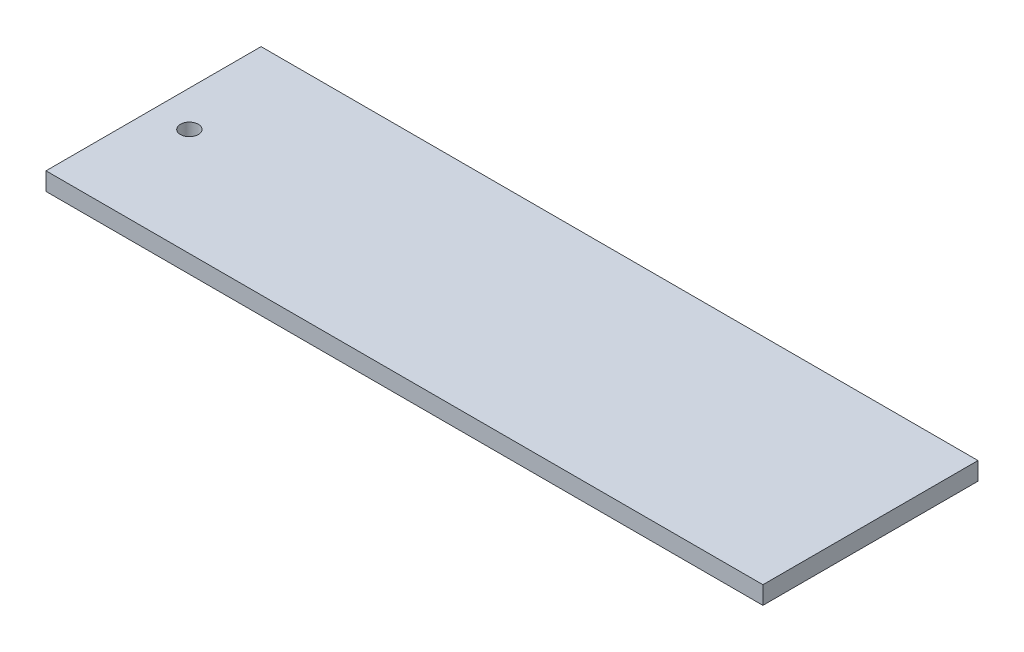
ISO-10303-21;
HEADER;
FILE_DESCRIPTION(('STEP AP214'),'2;1');
FILE_NAME('part.step','',(''),(''),'','','');
FILE_SCHEMA(('AUTOMOTIVE_DESIGN { 1 0 10303 214 1 1 1 1 }'));
ENDSEC;
DATA;
#1=APPLICATION_CONTEXT('core data for automotive mechanical design processes');
#2=APPLICATION_PROTOCOL_DEFINITION('international standard','automotive_design',2000,#1);
#3=PRODUCT_CONTEXT('',#1,'mechanical');
#4=PRODUCT('Part','Part','',(#3));
#5=PRODUCT_RELATED_PRODUCT_CATEGORY('part','',(#4));
#6=PRODUCT_DEFINITION_FORMATION('','',#4);
#7=PRODUCT_DEFINITION_CONTEXT('part definition',#1,'design');
#8=PRODUCT_DEFINITION('design','',#6,#7);
#9=PRODUCT_DEFINITION_SHAPE('','',#8);
#10=(LENGTH_UNIT() NAMED_UNIT(*) SI_UNIT(.MILLI.,.METRE.));
#11=(NAMED_UNIT(*) PLANE_ANGLE_UNIT() SI_UNIT($,.RADIAN.));
#12=(NAMED_UNIT(*) SI_UNIT($,.STERADIAN.) SOLID_ANGLE_UNIT());
#13=UNCERTAINTY_MEASURE_WITH_UNIT(LENGTH_MEASURE(1.E-05),#10,'distance_accuracy_value','');
#14=(GEOMETRIC_REPRESENTATION_CONTEXT(3) GLOBAL_UNCERTAINTY_ASSIGNED_CONTEXT((#13)) GLOBAL_UNIT_ASSIGNED_CONTEXT((#10,
#11,#12)) REPRESENTATION_CONTEXT('',''));
#15=CARTESIAN_POINT('',(0.,0.,0.));
#16=DIRECTION('',(0.,0.,1.));
#17=DIRECTION('',(1.,0.,0.));
#18=AXIS2_PLACEMENT_3D('',#15,#16,#17);
#19=CARTESIAN_POINT('',(-49.9079050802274,6.35,37.3983518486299));
#20=DIRECTION('',(0.,1.,0.));
#21=DIRECTION('',(0.,0.,1.));
#22=AXIS2_PLACEMENT_3D('',#19,#20,#21);
#23=PLANE('',#22);
#24=DIRECTION('',(0.,0.,1.));
#25=VECTOR('',#24,1.);
#26=CARTESIAN_POINT('',(-49.9079050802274,6.35,-38.8016481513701));
#27=LINE('',#26,#25);
#28=CARTESIAN_POINT('',(-49.9079050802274,6.35,-38.8016481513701));
#29=VERTEX_POINT('',#28);
#30=CARTESIAN_POINT('',(-49.9079050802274,6.35,37.3983518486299));
#31=VERTEX_POINT('',#30);
#32=EDGE_CURVE('E83',#29,#31,#27,.T.);
#33=ORIENTED_EDGE('',*,*,#32,.T.);
#34=DIRECTION('',(1.,0.,0.));
#35=VECTOR('',#34,1.);
#36=CARTESIAN_POINT('',(-49.9079050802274,6.35,37.3983518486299));
#37=LINE('',#36,#35);
#38=CARTESIAN_POINT('',(204.092094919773,6.35,37.3983518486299));
#39=VERTEX_POINT('',#38);
#40=EDGE_CURVE('E78',#31,#39,#37,.T.);
#41=ORIENTED_EDGE('',*,*,#40,.T.);
#42=DIRECTION('',(0.,0.,-1.));
#43=VECTOR('',#42,1.);
#44=CARTESIAN_POINT('',(204.092094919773,6.35,-38.8016481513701));
#45=LINE('',#44,#43);
#46=CARTESIAN_POINT('',(204.092094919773,6.35,-38.8016481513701));
#47=VERTEX_POINT('',#46);
#48=EDGE_CURVE('E81',#39,#47,#45,.T.);
#49=ORIENTED_EDGE('',*,*,#48,.T.);
#50=DIRECTION('',(-1.,0.,0.));
#51=VECTOR('',#50,1.);
#52=CARTESIAN_POINT('',(-49.9079050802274,6.35,-38.8016481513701));
#53=LINE('',#52,#51);
#54=EDGE_CURVE('E48',#47,#29,#53,.T.);
#55=ORIENTED_EDGE('',*,*,#54,.T.);
#56=EDGE_LOOP('',(#33,#41,#49,#55));
#57=FACE_BOUND('',#56,.T.);
#58=CARTESIAN_POINT('',(-37.2079050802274,6.35,-0.701648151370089));
#59=DIRECTION('',(0.,1.,0.));
#60=DIRECTION('',(0.,0.,1.));
#61=AXIS2_PLACEMENT_3D('',#58,#59,#60);
#62=CIRCLE('',#61,3.17500000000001);
#63=CARTESIAN_POINT('',(-37.2079050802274,6.35,2.47335184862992));
#64=VERTEX_POINT('',#63);
#65=EDGE_CURVE('E98',#64,#64,#62,.T.);
#66=ORIENTED_EDGE('',*,*,#65,.F.);
#67=EDGE_LOOP('',(#66));
#68=FACE_BOUND('',#67,.T.);
#69=ADVANCED_FACE('F31',(#57,#68),#23,.T.);
#70=CARTESIAN_POINT('',(-49.9079050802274,0.,37.3983518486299));
#71=DIRECTION('',(0.,1.,0.));
#72=DIRECTION('',(0.,0.,1.));
#73=AXIS2_PLACEMENT_3D('',#70,#71,#72);
#74=PLANE('',#73);
#75=DIRECTION('',(0.,0.,1.));
#76=VECTOR('',#75,1.);
#77=CARTESIAN_POINT('',(-49.9079050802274,0.,-38.8016481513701));
#78=LINE('',#77,#76);
#79=CARTESIAN_POINT('',(-49.9079050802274,0.,-38.8016481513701));
#80=VERTEX_POINT('',#79);
#81=CARTESIAN_POINT('',(-49.9079050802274,0.,37.3983518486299));
#82=VERTEX_POINT('',#81);
#83=EDGE_CURVE('E95',#80,#82,#78,.T.);
#84=ORIENTED_EDGE('',*,*,#83,.F.);
#85=DIRECTION('',(-1.,0.,0.));
#86=VECTOR('',#85,1.);
#87=CARTESIAN_POINT('',(-49.9079050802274,0.,-38.8016481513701));
#88=LINE('',#87,#86);
#89=CARTESIAN_POINT('',(204.092094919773,0.,-38.8016481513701));
#90=VERTEX_POINT('',#89);
#91=EDGE_CURVE('E71',#90,#80,#88,.T.);
#92=ORIENTED_EDGE('',*,*,#91,.F.);
#93=DIRECTION('',(0.,0.,-1.));
#94=VECTOR('',#93,1.);
#95=CARTESIAN_POINT('',(204.092094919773,0.,-38.8016481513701));
#96=LINE('',#95,#94);
#97=CARTESIAN_POINT('',(204.092094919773,0.,37.3983518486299));
#98=VERTEX_POINT('',#97);
#99=EDGE_CURVE('E65',#98,#90,#96,.T.);
#100=ORIENTED_EDGE('',*,*,#99,.F.);
#101=DIRECTION('',(1.,0.,0.));
#102=VECTOR('',#101,1.);
#103=CARTESIAN_POINT('',(-49.9079050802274,0.,37.3983518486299));
#104=LINE('',#103,#102);
#105=EDGE_CURVE('E87',#82,#98,#104,.T.);
#106=ORIENTED_EDGE('',*,*,#105,.F.);
#107=EDGE_LOOP('',(#84,#92,#100,#106));
#108=FACE_BOUND('',#107,.T.);
#109=CARTESIAN_POINT('',(-37.2079050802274,0.,-0.701648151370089));
#110=DIRECTION('',(0.,1.,0.));
#111=DIRECTION('',(0.,0.,1.));
#112=AXIS2_PLACEMENT_3D('',#109,#110,#111);
#113=CIRCLE('',#112,3.17500000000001);
#114=CARTESIAN_POINT('',(-37.2079050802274,0.,2.47335184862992));
#115=VERTEX_POINT('',#114);
#116=EDGE_CURVE('E110',#115,#115,#113,.T.);
#117=ORIENTED_EDGE('',*,*,#116,.T.);
#118=EDGE_LOOP('',(#117));
#119=FACE_BOUND('',#118,.T.);
#120=ADVANCED_FACE('F106',(#108,#119),#74,.F.);
#121=CARTESIAN_POINT('',(-49.9079050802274,6.35,-38.8016481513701));
#122=DIRECTION('',(1.,0.,0.));
#123=DIRECTION('',(0.,0.,-1.));
#124=AXIS2_PLACEMENT_3D('',#121,#122,#123);
#125=PLANE('',#124);
#126=ORIENTED_EDGE('',*,*,#83,.T.);
#127=DIRECTION('',(0.,-1.,0.));
#128=VECTOR('',#127,1.);
#129=CARTESIAN_POINT('',(-49.9079050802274,6.35,37.3983518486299));
#130=LINE('',#129,#128);
#131=EDGE_CURVE('E11',#31,#82,#130,.T.);
#132=ORIENTED_EDGE('',*,*,#131,.F.);
#133=ORIENTED_EDGE('',*,*,#32,.F.);
#134=DIRECTION('',(0.,-1.,0.));
#135=VECTOR('',#134,1.);
#136=CARTESIAN_POINT('',(-49.9079050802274,6.35,-38.8016481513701));
#137=LINE('',#136,#135);
#138=EDGE_CURVE('E91',#29,#80,#137,.T.);
#139=ORIENTED_EDGE('',*,*,#138,.T.);
#140=EDGE_LOOP('',(#126,#132,#133,#139));
#141=FACE_BOUND('',#140,.T.);
#142=ADVANCED_FACE('F33',(#141),#125,.F.);
#143=CARTESIAN_POINT('',(-49.9079050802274,6.35,37.3983518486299));
#144=DIRECTION('',(0.,0.,-1.));
#145=DIRECTION('',(-1.,0.,0.));
#146=AXIS2_PLACEMENT_3D('',#143,#144,#145);
#147=PLANE('',#146);
#148=ORIENTED_EDGE('',*,*,#105,.T.);
#149=DIRECTION('',(0.,-1.,0.));
#150=VECTOR('',#149,1.);
#151=CARTESIAN_POINT('',(204.092094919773,6.35,37.3983518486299));
#152=LINE('',#151,#150);
#153=EDGE_CURVE('E40',#39,#98,#152,.T.);
#154=ORIENTED_EDGE('',*,*,#153,.F.);
#155=ORIENTED_EDGE('',*,*,#40,.F.);
#156=ORIENTED_EDGE('',*,*,#131,.T.);
#157=EDGE_LOOP('',(#148,#154,#155,#156));
#158=FACE_BOUND('',#157,.T.);
#159=ADVANCED_FACE('F86',(#158),#147,.F.);
#160=CARTESIAN_POINT('',(204.092094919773,6.35,-38.8016481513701));
#161=DIRECTION('',(-1.,0.,0.));
#162=DIRECTION('',(0.,0.,1.));
#163=AXIS2_PLACEMENT_3D('',#160,#161,#162);
#164=PLANE('',#163);
#165=ORIENTED_EDGE('',*,*,#99,.T.);
#166=DIRECTION('',(0.,-1.,0.));
#167=VECTOR('',#166,1.);
#168=CARTESIAN_POINT('',(204.092094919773,6.35,-38.8016481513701));
#169=LINE('',#168,#167);
#170=EDGE_CURVE('E88',#47,#90,#169,.T.);
#171=ORIENTED_EDGE('',*,*,#170,.F.);
#172=ORIENTED_EDGE('',*,*,#48,.F.);
#173=ORIENTED_EDGE('',*,*,#153,.T.);
#174=EDGE_LOOP('',(#165,#171,#172,#173));
#175=FACE_BOUND('',#174,.T.);
#176=ADVANCED_FACE('F89',(#175),#164,.F.);
#177=CARTESIAN_POINT('',(-49.9079050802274,6.35,-38.8016481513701));
#178=DIRECTION('',(0.,0.,1.));
#179=DIRECTION('',(1.,0.,0.));
#180=AXIS2_PLACEMENT_3D('',#177,#178,#179);
#181=PLANE('',#180);
#182=ORIENTED_EDGE('',*,*,#91,.T.);
#183=ORIENTED_EDGE('',*,*,#138,.F.);
#184=ORIENTED_EDGE('',*,*,#54,.F.);
#185=ORIENTED_EDGE('',*,*,#170,.T.);
#186=EDGE_LOOP('',(#182,#183,#184,#185));
#187=FACE_BOUND('',#186,.T.);
#188=ADVANCED_FACE('F103',(#187),#181,.F.);
#189=CARTESIAN_POINT('',(-37.2079050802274,6.35,-0.701648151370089));
#190=DIRECTION('',(0.,-1.,0.));
#191=DIRECTION('',(0.,0.,-1.));
#192=AXIS2_PLACEMENT_3D('',#189,#190,#191);
#193=CYLINDRICAL_SURFACE('',#192,3.17500000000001);
#194=ORIENTED_EDGE('',*,*,#65,.T.);
#195=EDGE_LOOP('',(#194));
#196=FACE_BOUND('',#195,.T.);
#197=ORIENTED_EDGE('',*,*,#116,.F.);
#198=EDGE_LOOP('',(#197));
#199=FACE_BOUND('',#198,.T.);
#200=ADVANCED_FACE('F116',(#196,#199),#193,.F.);
#201=CLOSED_SHELL('',(#69,#120,#142,#159,#176,#188,#200));
#202=MANIFOLD_SOLID_BREP('B2',#201);
#203=ADVANCED_BREP_SHAPE_REPRESENTATION('',(#18,#202),#14);
#204=SHAPE_DEFINITION_REPRESENTATION(#9,#203);
ENDSEC;
END-ISO-10303-21;
